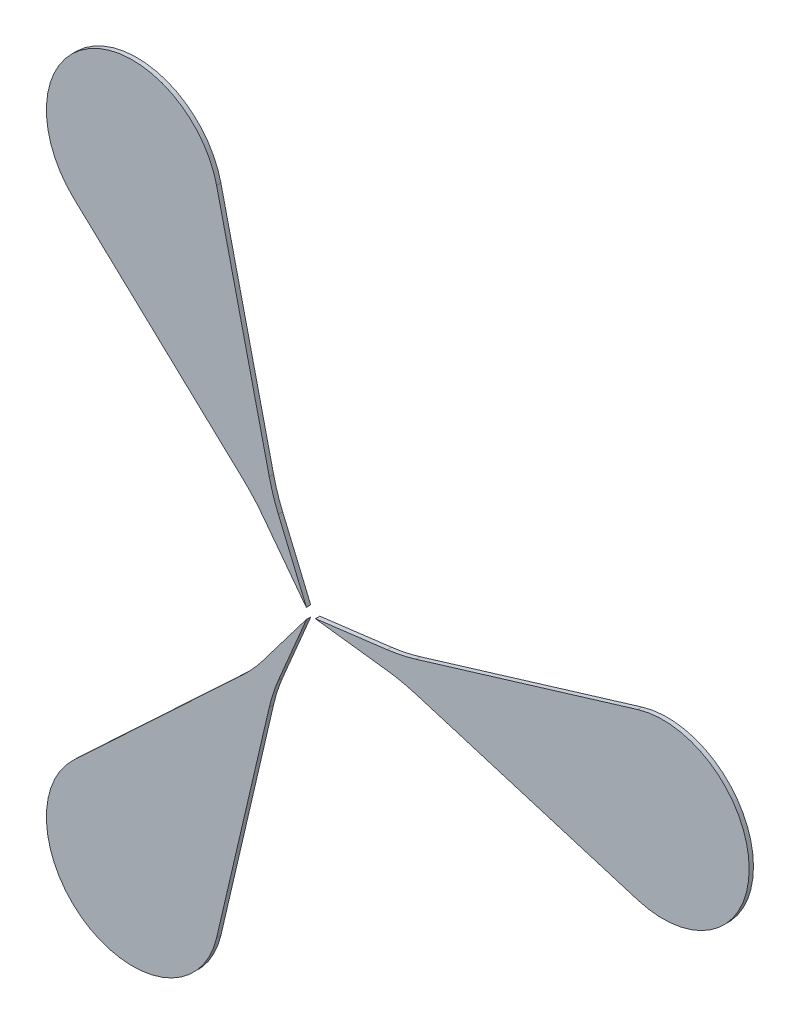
ISO-10303-21;
HEADER;
FILE_DESCRIPTION(('STEP AP214'),'2;1');
FILE_NAME('part.step','',(''),(''),'','','');
FILE_SCHEMA(('AUTOMOTIVE_DESIGN { 1 0 10303 214 1 1 1 1 }'));
ENDSEC;
DATA;
#1=APPLICATION_CONTEXT('core data for automotive mechanical design processes');
#2=APPLICATION_PROTOCOL_DEFINITION('international standard','automotive_design',2000,#1);
#3=PRODUCT_CONTEXT('',#1,'mechanical');
#4=PRODUCT('Part','Part','',(#3));
#5=PRODUCT_RELATED_PRODUCT_CATEGORY('part','',(#4));
#6=PRODUCT_DEFINITION_FORMATION('','',#4);
#7=PRODUCT_DEFINITION_CONTEXT('part definition',#1,'design');
#8=PRODUCT_DEFINITION('design','',#6,#7);
#9=PRODUCT_DEFINITION_SHAPE('','',#8);
#10=(LENGTH_UNIT() NAMED_UNIT(*) SI_UNIT(.MILLI.,.METRE.));
#11=(NAMED_UNIT(*) PLANE_ANGLE_UNIT() SI_UNIT($,.RADIAN.));
#12=(NAMED_UNIT(*) SI_UNIT($,.STERADIAN.) SOLID_ANGLE_UNIT());
#13=UNCERTAINTY_MEASURE_WITH_UNIT(LENGTH_MEASURE(1.E-05),#10,'distance_accuracy_value','');
#14=(GEOMETRIC_REPRESENTATION_CONTEXT(3) GLOBAL_UNCERTAINTY_ASSIGNED_CONTEXT((#13)) GLOBAL_UNIT_ASSIGNED_CONTEXT((#10,
#11,#12)) REPRESENTATION_CONTEXT('',''));
#15=CARTESIAN_POINT('',(0.,0.,0.));
#16=DIRECTION('',(0.,0.,1.));
#17=DIRECTION('',(1.,0.,0.));
#18=AXIS2_PLACEMENT_3D('',#15,#16,#17);
#19=CARTESIAN_POINT('',(-0.178999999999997,0.310037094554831,0.25));
#20=DIRECTION('',(0.,0.,-1.));
#21=DIRECTION('',(-1.,0.,0.));
#22=AXIS2_PLACEMENT_3D('',#19,#20,#21);
#23=CYLINDRICAL_SURFACE('',#22,0.00499999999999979);
#24=CARTESIAN_POINT('',(-0.178999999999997,0.310037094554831,0.));
#25=DIRECTION('',(0.,0.,1.));
#26=DIRECTION('',(1.,0.,0.));
#27=AXIS2_PLACEMENT_3D('',#24,#25,#26);
#28=CIRCLE('',#27,0.00499999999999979);
#29=CARTESIAN_POINT('',(-0.182987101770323,0.307019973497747,0.));
#30=VERTEX_POINT('',#29);
#31=CARTESIAN_POINT('',(-0.174393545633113,0.311981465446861,0.));
#32=VERTEX_POINT('',#31);
#33=EDGE_CURVE('E12',#30,#32,#28,.T.);
#34=ORIENTED_EDGE('',*,*,#33,.T.);
#35=DIRECTION('',(0.,0.,-1.));
#36=VECTOR('',#35,1.);
#37=CARTESIAN_POINT('',(-0.174393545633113,0.311981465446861,0.25));
#38=LINE('',#37,#36);
#39=CARTESIAN_POINT('',(-0.174393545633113,0.311981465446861,0.25));
#40=VERTEX_POINT('',#39);
#41=EDGE_CURVE('E184',#40,#32,#38,.T.);
#42=ORIENTED_EDGE('',*,*,#41,.F.);
#43=CARTESIAN_POINT('',(-0.178999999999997,0.310037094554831,0.25));
#44=DIRECTION('',(0.,0.,1.));
#45=DIRECTION('',(1.,0.,0.));
#46=AXIS2_PLACEMENT_3D('',#43,#44,#45);
#47=CIRCLE('',#46,0.00499999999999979);
#48=CARTESIAN_POINT('',(-0.182987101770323,0.307019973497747,0.25));
#49=VERTEX_POINT('',#48);
#50=EDGE_CURVE('E52',#49,#40,#47,.T.);
#51=ORIENTED_EDGE('',*,*,#50,.F.);
#52=DIRECTION('',(0.,0.,-1.));
#53=VECTOR('',#52,1.);
#54=CARTESIAN_POINT('',(-0.182987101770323,0.307019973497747,0.25));
#55=LINE('',#54,#53);
#56=EDGE_CURVE('E152',#49,#30,#55,.T.);
#57=ORIENTED_EDGE('',*,*,#56,.T.);
#58=EDGE_LOOP('',(#34,#42,#51,#57));
#59=FACE_BOUND('',#58,.T.);
#60=ADVANCED_FACE('F48',(#59),#23,.T.);
#61=CARTESIAN_POINT('',(-0.174393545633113,0.311981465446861,0.25));
#62=DIRECTION('',(-0.921290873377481,-0.388874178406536,0.));
#63=DIRECTION('',(0.388874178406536,-0.921290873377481,0.));
#64=AXIS2_PLACEMENT_3D('',#61,#62,#63);
#65=PLANE('',#64);
#66=DIRECTION('',(-0.388874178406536,0.921290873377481,0.));
#67=VECTOR('',#66,1.);
#68=CARTESIAN_POINT('',(-0.174393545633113,0.311981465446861,0.));
#69=LINE('',#68,#67);
#70=CARTESIAN_POINT('',(-1.80154369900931,4.16690079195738,0.));
#71=VERTEX_POINT('',#70);
#72=EDGE_CURVE('E58',#32,#71,#69,.T.);
#73=ORIENTED_EDGE('',*,*,#72,.T.);
#74=DIRECTION('',(0.,0.,-1.));
#75=VECTOR('',#74,1.);
#76=CARTESIAN_POINT('',(-1.80154369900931,4.16690079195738,0.25));
#77=LINE('',#76,#75);
#78=CARTESIAN_POINT('',(-1.80154369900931,4.16690079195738,0.25));
#79=VERTEX_POINT('',#78);
#80=EDGE_CURVE('E128',#79,#71,#77,.T.);
#81=ORIENTED_EDGE('',*,*,#80,.F.);
#82=DIRECTION('',(-0.388874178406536,0.921290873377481,0.));
#83=VECTOR('',#82,1.);
#84=CARTESIAN_POINT('',(-0.174393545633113,0.311981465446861,0.25));
#85=LINE('',#84,#83);
#86=EDGE_CURVE('E94',#40,#79,#85,.T.);
#87=ORIENTED_EDGE('',*,*,#86,.F.);
#88=ORIENTED_EDGE('',*,*,#41,.T.);
#89=EDGE_LOOP('',(#73,#81,#87,#88));
#90=FACE_BOUND('',#89,.T.);
#91=ADVANCED_FACE('F190',(#90),#65,.F.);
#92=CARTESIAN_POINT('',(7.41136503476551,8.05564257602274,0.25));
#93=DIRECTION('',(0.,0.,-1.));
#94=DIRECTION('',(-1.,0.,0.));
#95=AXIS2_PLACEMENT_3D('',#92,#93,#94);
#96=CYLINDRICAL_SURFACE('',#95,10.);
#97=CARTESIAN_POINT('',(7.41136503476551,8.05564257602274,0.));
#98=DIRECTION('',(0.,0.,-1.));
#99=DIRECTION('',(-1.,0.,0.));
#100=AXIS2_PLACEMENT_3D('',#97,#98,#99);
#101=CIRCLE('',#100,10.);
#102=CARTESIAN_POINT('',(-2.32776938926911,5.78644433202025,0.));
#103=VERTEX_POINT('',#102);
#104=EDGE_CURVE('E122',#71,#103,#101,.T.);
#105=ORIENTED_EDGE('',*,*,#104,.T.);
#106=DIRECTION('',(0.,0.,-1.));
#107=VECTOR('',#106,1.);
#108=CARTESIAN_POINT('',(-2.32776938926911,5.78644433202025,0.25));
#109=LINE('',#108,#107);
#110=CARTESIAN_POINT('',(-2.32776938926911,5.78644433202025,0.25));
#111=VERTEX_POINT('',#110);
#112=EDGE_CURVE('E126',#111,#103,#109,.T.);
#113=ORIENTED_EDGE('',*,*,#112,.F.);
#114=CARTESIAN_POINT('',(7.41136503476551,8.05564257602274,0.25));
#115=DIRECTION('',(0.,0.,-1.));
#116=DIRECTION('',(-1.,0.,0.));
#117=AXIS2_PLACEMENT_3D('',#114,#115,#116);
#118=CIRCLE('',#117,10.);
#119=EDGE_CURVE('E159',#79,#111,#118,.T.);
#120=ORIENTED_EDGE('',*,*,#119,.F.);
#121=ORIENTED_EDGE('',*,*,#80,.T.);
#122=EDGE_LOOP('',(#105,#113,#120,#121));
#123=FACE_BOUND('',#122,.T.);
#124=ADVANCED_FACE('F124',(#123),#96,.F.);
#125=CARTESIAN_POINT('',(-2.32776938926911,5.78644433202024,0.25));
#126=DIRECTION('',(-0.973913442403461,-0.226919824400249,0.));
#127=DIRECTION('',(0.226919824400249,-0.973913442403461,0.));
#128=AXIS2_PLACEMENT_3D('',#125,#126,#127);
#129=PLANE('',#128);
#130=DIRECTION('',(-0.226919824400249,0.973913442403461,0.));
#131=VECTOR('',#130,1.);
#132=CARTESIAN_POINT('',(-2.32776938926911,5.78644433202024,0.));
#133=LINE('',#132,#131);
#134=CARTESIAN_POINT('',(-5.3804327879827,18.8881198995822,0.));
#135=VERTEX_POINT('',#134);
#136=EDGE_CURVE('E130',#103,#135,#133,.T.);
#137=ORIENTED_EDGE('',*,*,#136,.T.);
#138=DIRECTION('',(0.,0.,-1.));
#139=VECTOR('',#138,1.);
#140=CARTESIAN_POINT('',(-5.3804327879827,18.8881198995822,0.25));
#141=LINE('',#140,#139);
#142=CARTESIAN_POINT('',(-5.3804327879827,18.8881198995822,0.25));
#143=VERTEX_POINT('',#142);
#144=EDGE_CURVE('E137',#143,#135,#141,.T.);
#145=ORIENTED_EDGE('',*,*,#144,.F.);
#146=DIRECTION('',(-0.226919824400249,0.973913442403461,0.));
#147=VECTOR('',#146,1.);
#148=CARTESIAN_POINT('',(-2.32776938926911,5.78644433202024,0.25));
#149=LINE('',#148,#147);
#150=EDGE_CURVE('E136',#111,#143,#149,.T.);
#151=ORIENTED_EDGE('',*,*,#150,.F.);
#152=ORIENTED_EDGE('',*,*,#112,.T.);
#153=EDGE_LOOP('',(#137,#145,#151,#152));
#154=FACE_BOUND('',#153,.T.);
#155=ADVANCED_FACE('F133',(#154),#129,.F.);
#156=CARTESIAN_POINT('',(-10.25,17.753520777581,0.25));
#157=DIRECTION('',(0.,0.,-1.));
#158=DIRECTION('',(-1.,0.,0.));
#159=AXIS2_PLACEMENT_3D('',#156,#157,#158);
#160=CYLINDRICAL_SURFACE('',#159,5.);
#161=CARTESIAN_POINT('',(-10.25,17.753520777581,0.));
#162=DIRECTION('',(0.,0.,1.));
#163=DIRECTION('',(1.,0.,0.));
#164=AXIS2_PLACEMENT_3D('',#161,#162,#163);
#165=CIRCLE('',#164,5.);
#166=CARTESIAN_POINT('',(-13.6673752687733,14.1036514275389,0.));
#167=VERTEX_POINT('',#166);
#168=EDGE_CURVE('E142',#135,#167,#165,.T.);
#169=ORIENTED_EDGE('',*,*,#168,.T.);
#170=DIRECTION('',(0.,0.,-1.));
#171=VECTOR('',#170,1.);
#172=CARTESIAN_POINT('',(-13.6673752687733,14.1036514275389,0.25));
#173=LINE('',#172,#171);
#174=CARTESIAN_POINT('',(-13.6673752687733,14.1036514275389,0.25));
#175=VERTEX_POINT('',#174);
#176=EDGE_CURVE('E176',#175,#167,#173,.T.);
#177=ORIENTED_EDGE('',*,*,#176,.F.);
#178=CARTESIAN_POINT('',(-10.25,17.753520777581,0.25));
#179=DIRECTION('',(0.,0.,1.));
#180=DIRECTION('',(1.,0.,0.));
#181=AXIS2_PLACEMENT_3D('',#178,#179,#180);
#182=CIRCLE('',#181,5.);
#183=EDGE_CURVE('E156',#143,#175,#182,.T.);
#184=ORIENTED_EDGE('',*,*,#183,.F.);
#185=ORIENTED_EDGE('',*,*,#144,.T.);
#186=EDGE_LOOP('',(#169,#177,#184,#185));
#187=FACE_BOUND('',#186,.T.);
#188=ADVANCED_FACE('F193',(#187),#160,.T.);
#189=CARTESIAN_POINT('',(-3.84732309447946,4.90912959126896,0.25));
#190=DIRECTION('',(0.68347505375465,0.729973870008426,0.));
#191=DIRECTION('',(-0.729973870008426,0.68347505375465,0.));
#192=AXIS2_PLACEMENT_3D('',#189,#190,#191);
#193=PLANE('',#192);
#194=DIRECTION('',(0.729973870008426,-0.68347505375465,0.));
#195=VECTOR('',#194,1.);
#196=CARTESIAN_POINT('',(-3.84732309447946,4.90912959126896,0.));
#197=LINE('',#196,#195);
#198=CARTESIAN_POINT('',(-3.84732309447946,4.90912959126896,0.));
#199=VERTEX_POINT('',#198);
#200=EDGE_CURVE('E144',#167,#199,#197,.T.);
#201=ORIENTED_EDGE('',*,*,#200,.T.);
#202=DIRECTION('',(0.,0.,-1.));
#203=VECTOR('',#202,1.);
#204=CARTESIAN_POINT('',(-3.84732309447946,4.90912959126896,0.25));
#205=LINE('',#204,#203);
#206=CARTESIAN_POINT('',(-3.84732309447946,4.90912959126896,0.25));
#207=VERTEX_POINT('',#206);
#208=EDGE_CURVE('E173',#207,#199,#205,.T.);
#209=ORIENTED_EDGE('',*,*,#208,.F.);
#210=DIRECTION('',(0.729973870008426,-0.68347505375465,0.));
#211=VECTOR('',#210,1.);
#212=CARTESIAN_POINT('',(-3.84732309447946,4.90912959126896,0.25));
#213=LINE('',#212,#211);
#214=EDGE_CURVE('E154',#175,#207,#213,.T.);
#215=ORIENTED_EDGE('',*,*,#214,.F.);
#216=ORIENTED_EDGE('',*,*,#176,.T.);
#217=EDGE_LOOP('',(#201,#209,#215,#216));
#218=FACE_BOUND('',#217,.T.);
#219=ADVANCED_FACE('F171',(#218),#193,.F.);
#220=CARTESIAN_POINT('',(-10.682073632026,-2.39060910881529,0.25));
#221=DIRECTION('',(0.,0.,-1.));
#222=DIRECTION('',(-1.,0.,0.));
#223=AXIS2_PLACEMENT_3D('',#220,#221,#222);
#224=CYLINDRICAL_SURFACE('',#223,10.);
#225=CARTESIAN_POINT('',(-10.682073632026,-2.39060910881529,0.));
#226=DIRECTION('',(0.,0.,-1.));
#227=DIRECTION('',(1.,0.,0.));
#228=AXIS2_PLACEMENT_3D('',#225,#226,#227);
#229=CIRCLE('',#228,10.);
#230=CARTESIAN_POINT('',(-2.70787009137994,3.64363300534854,0.));
#231=VERTEX_POINT('',#230);
#232=EDGE_CURVE('E162',#199,#231,#229,.T.);
#233=ORIENTED_EDGE('',*,*,#232,.T.);
#234=DIRECTION('',(0.,0.,-1.));
#235=VECTOR('',#234,1.);
#236=CARTESIAN_POINT('',(-2.70787009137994,3.64363300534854,0.25));
#237=LINE('',#236,#235);
#238=CARTESIAN_POINT('',(-2.70787009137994,3.64363300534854,0.25));
#239=VERTEX_POINT('',#238);
#240=EDGE_CURVE('E181',#239,#231,#237,.T.);
#241=ORIENTED_EDGE('',*,*,#240,.F.);
#242=CARTESIAN_POINT('',(-10.682073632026,-2.39060910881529,0.25));
#243=DIRECTION('',(0.,0.,-1.));
#244=DIRECTION('',(1.,0.,0.));
#245=AXIS2_PLACEMENT_3D('',#242,#243,#244);
#246=CIRCLE('',#245,10.);
#247=EDGE_CURVE('E151',#207,#239,#246,.T.);
#248=ORIENTED_EDGE('',*,*,#247,.F.);
#249=ORIENTED_EDGE('',*,*,#208,.T.);
#250=EDGE_LOOP('',(#233,#241,#248,#249));
#251=FACE_BOUND('',#250,.T.);
#252=ADVANCED_FACE('F179',(#251),#224,.F.);
#253=CARTESIAN_POINT('',(-0.182987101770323,0.307019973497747,0.25));
#254=DIRECTION('',(0.797420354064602,0.603424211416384,0.));
#255=DIRECTION('',(-0.603424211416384,0.797420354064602,0.));
#256=AXIS2_PLACEMENT_3D('',#253,#254,#255);
#257=PLANE('',#256);
#258=DIRECTION('',(0.603424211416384,-0.797420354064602,0.));
#259=VECTOR('',#258,1.);
#260=CARTESIAN_POINT('',(-0.182987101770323,0.307019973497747,0.));
#261=LINE('',#260,#259);
#262=EDGE_CURVE('E105',#231,#30,#261,.T.);
#263=ORIENTED_EDGE('',*,*,#262,.T.);
#264=ORIENTED_EDGE('',*,*,#56,.F.);
#265=DIRECTION('',(0.603424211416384,-0.797420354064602,0.));
#266=VECTOR('',#265,1.);
#267=CARTESIAN_POINT('',(-0.182987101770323,0.307019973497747,0.25));
#268=LINE('',#267,#266);
#269=EDGE_CURVE('E149',#239,#49,#268,.T.);
#270=ORIENTED_EDGE('',*,*,#269,.F.);
#271=ORIENTED_EDGE('',*,*,#240,.T.);
#272=EDGE_LOOP('',(#263,#264,#270,#271));
#273=FACE_BOUND('',#272,.T.);
#274=ADVANCED_FACE('F194',(#273),#257,.F.);
#275=CARTESIAN_POINT('',(-0.178999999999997,0.310037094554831,0.25));
#276=DIRECTION('',(0.,0.,1.));
#277=DIRECTION('',(1.,0.,0.));
#278=AXIS2_PLACEMENT_3D('',#275,#276,#277);
#279=PLANE('',#278);
#280=ORIENTED_EDGE('',*,*,#50,.T.);
#281=ORIENTED_EDGE('',*,*,#86,.T.);
#282=ORIENTED_EDGE('',*,*,#119,.T.);
#283=ORIENTED_EDGE('',*,*,#150,.T.);
#284=ORIENTED_EDGE('',*,*,#183,.T.);
#285=ORIENTED_EDGE('',*,*,#214,.T.);
#286=ORIENTED_EDGE('',*,*,#247,.T.);
#287=ORIENTED_EDGE('',*,*,#269,.T.);
#288=EDGE_LOOP('',(#280,#281,#282,#283,#284,#285,#286,#287));
#289=FACE_BOUND('',#288,.T.);
#290=ADVANCED_FACE('F50',(#289),#279,.T.);
#291=CARTESIAN_POINT('',(-0.178999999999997,0.310037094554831,0.));
#292=DIRECTION('',(0.,0.,1.));
#293=DIRECTION('',(1.,0.,0.));
#294=AXIS2_PLACEMENT_3D('',#291,#292,#293);
#295=PLANE('',#294);
#296=ORIENTED_EDGE('',*,*,#33,.F.);
#297=ORIENTED_EDGE('',*,*,#262,.F.);
#298=ORIENTED_EDGE('',*,*,#232,.F.);
#299=ORIENTED_EDGE('',*,*,#200,.F.);
#300=ORIENTED_EDGE('',*,*,#168,.F.);
#301=ORIENTED_EDGE('',*,*,#136,.F.);
#302=ORIENTED_EDGE('',*,*,#104,.F.);
#303=ORIENTED_EDGE('',*,*,#72,.F.);
#304=EDGE_LOOP('',(#296,#297,#298,#299,#300,#301,#302,#303));
#305=FACE_BOUND('',#304,.T.);
#306=ADVANCED_FACE('F140',(#305),#295,.F.);
#307=CLOSED_SHELL('',(#60,#91,#124,#155,#188,#219,#252,#274,#290,#306));
#308=MANIFOLD_SOLID_BREP('B2',#307);
#309=CARTESIAN_POINT('',(-0.179,-0.310037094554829,0.25));
#310=DIRECTION('',(0.,0.,-1.));
#311=DIRECTION('',(-1.,0.,0.));
#312=AXIS2_PLACEMENT_3D('',#309,#310,#311);
#313=CYLINDRICAL_SURFACE('',#312,0.00499999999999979);
#314=CARTESIAN_POINT('',(-0.179,-0.310037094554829,0.));
#315=DIRECTION('',(0.,0.,1.));
#316=DIRECTION('',(1.,0.,0.));
#317=AXIS2_PLACEMENT_3D('',#314,#315,#316);
#318=CIRCLE('',#317,0.00499999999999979);
#319=CARTESIAN_POINT('',(-0.174393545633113,-0.311981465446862,0.));
#320=VERTEX_POINT('',#319);
#321=CARTESIAN_POINT('',(-0.182987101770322,-0.307019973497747,0.));
#322=VERTEX_POINT('',#321);
#323=EDGE_CURVE('E46',#320,#322,#318,.T.);
#324=ORIENTED_EDGE('',*,*,#323,.T.);
#325=DIRECTION('',(0.,0.,-1.));
#326=VECTOR('',#325,1.);
#327=CARTESIAN_POINT('',(-0.182987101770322,-0.307019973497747,0.25));
#328=LINE('',#327,#326);
#329=CARTESIAN_POINT('',(-0.182987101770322,-0.307019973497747,0.25));
#330=VERTEX_POINT('',#329);
#331=EDGE_CURVE('E441',#330,#322,#328,.T.);
#332=ORIENTED_EDGE('',*,*,#331,.F.);
#333=CARTESIAN_POINT('',(-0.179,-0.310037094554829,0.25));
#334=DIRECTION('',(0.,0.,1.));
#335=DIRECTION('',(1.,0.,0.));
#336=AXIS2_PLACEMENT_3D('',#333,#334,#335);
#337=CIRCLE('',#336,0.00499999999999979);
#338=CARTESIAN_POINT('',(-0.174393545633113,-0.311981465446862,0.25));
#339=VERTEX_POINT('',#338);
#340=EDGE_CURVE('E309',#339,#330,#337,.T.);
#341=ORIENTED_EDGE('',*,*,#340,.F.);
#342=DIRECTION('',(0.,0.,-1.));
#343=VECTOR('',#342,1.);
#344=CARTESIAN_POINT('',(-0.174393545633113,-0.311981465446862,0.25));
#345=LINE('',#344,#343);
#346=EDGE_CURVE('E409',#339,#320,#345,.T.);
#347=ORIENTED_EDGE('',*,*,#346,.T.);
#348=EDGE_LOOP('',(#324,#332,#341,#347));
#349=FACE_BOUND('',#348,.T.);
#350=ADVANCED_FACE('F305',(#349),#313,.T.);
#351=CARTESIAN_POINT('',(-0.182987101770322,-0.307019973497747,0.25));
#352=DIRECTION('',(0.797420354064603,-0.603424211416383,0.));
#353=DIRECTION('',(0.603424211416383,0.797420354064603,0.));
#354=AXIS2_PLACEMENT_3D('',#351,#352,#353);
#355=PLANE('',#354);
#356=DIRECTION('',(-0.603424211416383,-0.797420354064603,0.));
#357=VECTOR('',#356,1.);
#358=CARTESIAN_POINT('',(-0.182987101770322,-0.307019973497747,0.));
#359=LINE('',#358,#357);
#360=CARTESIAN_POINT('',(-2.70787009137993,-3.64363300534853,0.));
#361=VERTEX_POINT('',#360);
#362=EDGE_CURVE('E315',#322,#361,#359,.T.);
#363=ORIENTED_EDGE('',*,*,#362,.T.);
#364=DIRECTION('',(0.,0.,-1.));
#365=VECTOR('',#364,1.);
#366=CARTESIAN_POINT('',(-2.70787009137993,-3.64363300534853,0.25));
#367=LINE('',#366,#365);
#368=CARTESIAN_POINT('',(-2.70787009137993,-3.64363300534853,0.25));
#369=VERTEX_POINT('',#368);
#370=EDGE_CURVE('E385',#369,#361,#367,.T.);
#371=ORIENTED_EDGE('',*,*,#370,.F.);
#372=DIRECTION('',(-0.603424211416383,-0.797420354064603,0.));
#373=VECTOR('',#372,1.);
#374=CARTESIAN_POINT('',(-0.182987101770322,-0.307019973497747,0.25));
#375=LINE('',#374,#373);
#376=EDGE_CURVE('E351',#330,#369,#375,.T.);
#377=ORIENTED_EDGE('',*,*,#376,.F.);
#378=ORIENTED_EDGE('',*,*,#331,.T.);
#379=EDGE_LOOP('',(#363,#371,#377,#378));
#380=FACE_BOUND('',#379,.T.);
#381=ADVANCED_FACE('F447',(#380),#355,.F.);
#382=CARTESIAN_POINT('',(-10.682073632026,2.39060910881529,0.25));
#383=DIRECTION('',(0.,0.,-1.));
#384=DIRECTION('',(-1.,0.,0.));
#385=AXIS2_PLACEMENT_3D('',#382,#383,#384);
#386=CYLINDRICAL_SURFACE('',#385,10.);
#387=CARTESIAN_POINT('',(-10.682073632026,2.39060910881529,0.));
#388=DIRECTION('',(0.,0.,-1.));
#389=DIRECTION('',(-1.,0.,0.));
#390=AXIS2_PLACEMENT_3D('',#387,#388,#389);
#391=CIRCLE('',#390,10.);
#392=CARTESIAN_POINT('',(-3.84732309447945,-4.90912959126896,0.));
#393=VERTEX_POINT('',#392);
#394=EDGE_CURVE('E379',#361,#393,#391,.T.);
#395=ORIENTED_EDGE('',*,*,#394,.T.);
#396=DIRECTION('',(0.,0.,-1.));
#397=VECTOR('',#396,1.);
#398=CARTESIAN_POINT('',(-3.84732309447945,-4.90912959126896,0.25));
#399=LINE('',#398,#397);
#400=CARTESIAN_POINT('',(-3.84732309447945,-4.90912959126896,0.25));
#401=VERTEX_POINT('',#400);
#402=EDGE_CURVE('E383',#401,#393,#399,.T.);
#403=ORIENTED_EDGE('',*,*,#402,.F.);
#404=CARTESIAN_POINT('',(-10.682073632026,2.39060910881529,0.25));
#405=DIRECTION('',(0.,0.,-1.));
#406=DIRECTION('',(-1.,0.,0.));
#407=AXIS2_PLACEMENT_3D('',#404,#405,#406);
#408=CIRCLE('',#407,10.);
#409=EDGE_CURVE('E416',#369,#401,#408,.T.);
#410=ORIENTED_EDGE('',*,*,#409,.F.);
#411=ORIENTED_EDGE('',*,*,#370,.T.);
#412=EDGE_LOOP('',(#395,#403,#410,#411));
#413=FACE_BOUND('',#412,.T.);
#414=ADVANCED_FACE('F381',(#413),#386,.F.);
#415=CARTESIAN_POINT('',(-3.84732309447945,-4.90912959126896,0.25));
#416=DIRECTION('',(0.68347505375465,-0.729973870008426,0.));
#417=DIRECTION('',(0.729973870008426,0.68347505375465,0.));
#418=AXIS2_PLACEMENT_3D('',#415,#416,#417);
#419=PLANE('',#418);
#420=DIRECTION('',(-0.729973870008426,-0.68347505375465,0.));
#421=VECTOR('',#420,1.);
#422=CARTESIAN_POINT('',(-3.84732309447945,-4.90912959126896,0.));
#423=LINE('',#422,#421);
#424=CARTESIAN_POINT('',(-13.6673752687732,-14.1036514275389,0.));
#425=VERTEX_POINT('',#424);
#426=EDGE_CURVE('E387',#393,#425,#423,.T.);
#427=ORIENTED_EDGE('',*,*,#426,.T.);
#428=DIRECTION('',(0.,0.,-1.));
#429=VECTOR('',#428,1.);
#430=CARTESIAN_POINT('',(-13.6673752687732,-14.1036514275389,0.25));
#431=LINE('',#430,#429);
#432=CARTESIAN_POINT('',(-13.6673752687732,-14.1036514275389,0.25));
#433=VERTEX_POINT('',#432);
#434=EDGE_CURVE('E394',#433,#425,#431,.T.);
#435=ORIENTED_EDGE('',*,*,#434,.F.);
#436=DIRECTION('',(-0.729973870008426,-0.68347505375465,0.));
#437=VECTOR('',#436,1.);
#438=CARTESIAN_POINT('',(-3.84732309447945,-4.90912959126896,0.25));
#439=LINE('',#438,#437);
#440=EDGE_CURVE('E393',#401,#433,#439,.T.);
#441=ORIENTED_EDGE('',*,*,#440,.F.);
#442=ORIENTED_EDGE('',*,*,#402,.T.);
#443=EDGE_LOOP('',(#427,#435,#441,#442));
#444=FACE_BOUND('',#443,.T.);
#445=ADVANCED_FACE('F390',(#444),#419,.F.);
#446=CARTESIAN_POINT('',(-10.25,-17.753520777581,0.25));
#447=DIRECTION('',(0.,0.,-1.));
#448=DIRECTION('',(-1.,0.,0.));
#449=AXIS2_PLACEMENT_3D('',#446,#447,#448);
#450=CYLINDRICAL_SURFACE('',#449,5.);
#451=CARTESIAN_POINT('',(-10.25,-17.753520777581,0.));
#452=DIRECTION('',(0.,0.,1.));
#453=DIRECTION('',(1.,0.,0.));
#454=AXIS2_PLACEMENT_3D('',#451,#452,#453);
#455=CIRCLE('',#454,5.);
#456=CARTESIAN_POINT('',(-5.38043278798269,-18.8881198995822,0.));
#457=VERTEX_POINT('',#456);
#458=EDGE_CURVE('E399',#425,#457,#455,.T.);
#459=ORIENTED_EDGE('',*,*,#458,.T.);
#460=DIRECTION('',(0.,0.,-1.));
#461=VECTOR('',#460,1.);
#462=CARTESIAN_POINT('',(-5.38043278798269,-18.8881198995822,0.25));
#463=LINE('',#462,#461);
#464=CARTESIAN_POINT('',(-5.38043278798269,-18.8881198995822,0.25));
#465=VERTEX_POINT('',#464);
#466=EDGE_CURVE('E433',#465,#457,#463,.T.);
#467=ORIENTED_EDGE('',*,*,#466,.F.);
#468=CARTESIAN_POINT('',(-10.25,-17.753520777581,0.25));
#469=DIRECTION('',(0.,0.,1.));
#470=DIRECTION('',(1.,0.,0.));
#471=AXIS2_PLACEMENT_3D('',#468,#469,#470);
#472=CIRCLE('',#471,5.);
#473=EDGE_CURVE('E413',#433,#465,#472,.T.);
#474=ORIENTED_EDGE('',*,*,#473,.F.);
#475=ORIENTED_EDGE('',*,*,#434,.T.);
#476=EDGE_LOOP('',(#459,#467,#474,#475));
#477=FACE_BOUND('',#476,.T.);
#478=ADVANCED_FACE('F450',(#477),#450,.T.);
#479=CARTESIAN_POINT('',(-2.32776938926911,-5.78644433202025,0.25));
#480=DIRECTION('',(-0.973913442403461,0.226919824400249,0.));
#481=DIRECTION('',(-0.226919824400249,-0.973913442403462,0.));
#482=AXIS2_PLACEMENT_3D('',#479,#480,#481);
#483=PLANE('',#482);
#484=DIRECTION('',(0.226919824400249,0.973913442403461,0.));
#485=VECTOR('',#484,1.);
#486=CARTESIAN_POINT('',(-2.32776938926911,-5.78644433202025,0.));
#487=LINE('',#486,#485);
#488=CARTESIAN_POINT('',(-2.32776938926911,-5.78644433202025,0.));
#489=VERTEX_POINT('',#488);
#490=EDGE_CURVE('E401',#457,#489,#487,.T.);
#491=ORIENTED_EDGE('',*,*,#490,.T.);
#492=DIRECTION('',(0.,0.,-1.));
#493=VECTOR('',#492,1.);
#494=CARTESIAN_POINT('',(-2.32776938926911,-5.78644433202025,0.25));
#495=LINE('',#494,#493);
#496=CARTESIAN_POINT('',(-2.32776938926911,-5.78644433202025,0.25));
#497=VERTEX_POINT('',#496);
#498=EDGE_CURVE('E430',#497,#489,#495,.T.);
#499=ORIENTED_EDGE('',*,*,#498,.F.);
#500=DIRECTION('',(0.226919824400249,0.973913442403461,0.));
#501=VECTOR('',#500,1.);
#502=CARTESIAN_POINT('',(-2.32776938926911,-5.78644433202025,0.25));
#503=LINE('',#502,#501);
#504=EDGE_CURVE('E411',#465,#497,#503,.T.);
#505=ORIENTED_EDGE('',*,*,#504,.F.);
#506=ORIENTED_EDGE('',*,*,#466,.T.);
#507=EDGE_LOOP('',(#491,#499,#505,#506));
#508=FACE_BOUND('',#507,.T.);
#509=ADVANCED_FACE('F428',(#508),#483,.F.);
#510=CARTESIAN_POINT('',(7.41136503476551,-8.05564257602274,0.25));
#511=DIRECTION('',(0.,0.,-1.));
#512=DIRECTION('',(-1.,0.,0.));
#513=AXIS2_PLACEMENT_3D('',#510,#511,#512);
#514=CYLINDRICAL_SURFACE('',#513,10.);
#515=CARTESIAN_POINT('',(7.41136503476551,-8.05564257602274,0.));
#516=DIRECTION('',(0.,0.,-1.));
#517=DIRECTION('',(1.,0.,0.));
#518=AXIS2_PLACEMENT_3D('',#515,#516,#517);
#519=CIRCLE('',#518,10.);
#520=CARTESIAN_POINT('',(-1.80154369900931,-4.16690079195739,0.));
#521=VERTEX_POINT('',#520);
#522=EDGE_CURVE('E419',#489,#521,#519,.T.);
#523=ORIENTED_EDGE('',*,*,#522,.T.);
#524=DIRECTION('',(0.,0.,-1.));
#525=VECTOR('',#524,1.);
#526=CARTESIAN_POINT('',(-1.80154369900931,-4.16690079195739,0.25));
#527=LINE('',#526,#525);
#528=CARTESIAN_POINT('',(-1.80154369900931,-4.16690079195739,0.25));
#529=VERTEX_POINT('',#528);
#530=EDGE_CURVE('E438',#529,#521,#527,.T.);
#531=ORIENTED_EDGE('',*,*,#530,.F.);
#532=CARTESIAN_POINT('',(7.41136503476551,-8.05564257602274,0.25));
#533=DIRECTION('',(0.,0.,-1.));
#534=DIRECTION('',(1.,0.,0.));
#535=AXIS2_PLACEMENT_3D('',#532,#533,#534);
#536=CIRCLE('',#535,10.);
#537=EDGE_CURVE('E408',#497,#529,#536,.T.);
#538=ORIENTED_EDGE('',*,*,#537,.F.);
#539=ORIENTED_EDGE('',*,*,#498,.T.);
#540=EDGE_LOOP('',(#523,#531,#538,#539));
#541=FACE_BOUND('',#540,.T.);
#542=ADVANCED_FACE('F436',(#541),#514,.F.);
#543=CARTESIAN_POINT('',(-0.174393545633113,-0.311981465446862,0.25));
#544=DIRECTION('',(-0.921290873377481,0.388874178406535,0.));
#545=DIRECTION('',(-0.388874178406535,-0.921290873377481,0.));
#546=AXIS2_PLACEMENT_3D('',#543,#544,#545);
#547=PLANE('',#546);
#548=DIRECTION('',(0.388874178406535,0.921290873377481,0.));
#549=VECTOR('',#548,1.);
#550=CARTESIAN_POINT('',(-0.174393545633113,-0.311981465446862,0.));
#551=LINE('',#550,#549);
#552=EDGE_CURVE('E362',#521,#320,#551,.T.);
#553=ORIENTED_EDGE('',*,*,#552,.T.);
#554=ORIENTED_EDGE('',*,*,#346,.F.);
#555=DIRECTION('',(0.388874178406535,0.921290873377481,0.));
#556=VECTOR('',#555,1.);
#557=CARTESIAN_POINT('',(-0.174393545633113,-0.311981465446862,0.25));
#558=LINE('',#557,#556);
#559=EDGE_CURVE('E406',#529,#339,#558,.T.);
#560=ORIENTED_EDGE('',*,*,#559,.F.);
#561=ORIENTED_EDGE('',*,*,#530,.T.);
#562=EDGE_LOOP('',(#553,#554,#560,#561));
#563=FACE_BOUND('',#562,.T.);
#564=ADVANCED_FACE('F451',(#563),#547,.F.);
#565=CARTESIAN_POINT('',(-0.179,-0.310037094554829,0.25));
#566=DIRECTION('',(0.,0.,1.));
#567=DIRECTION('',(1.,0.,0.));
#568=AXIS2_PLACEMENT_3D('',#565,#566,#567);
#569=PLANE('',#568);
#570=ORIENTED_EDGE('',*,*,#340,.T.);
#571=ORIENTED_EDGE('',*,*,#376,.T.);
#572=ORIENTED_EDGE('',*,*,#409,.T.);
#573=ORIENTED_EDGE('',*,*,#440,.T.);
#574=ORIENTED_EDGE('',*,*,#473,.T.);
#575=ORIENTED_EDGE('',*,*,#504,.T.);
#576=ORIENTED_EDGE('',*,*,#537,.T.);
#577=ORIENTED_EDGE('',*,*,#559,.T.);
#578=EDGE_LOOP('',(#570,#571,#572,#573,#574,#575,#576,#577));
#579=FACE_BOUND('',#578,.T.);
#580=ADVANCED_FACE('F307',(#579),#569,.T.);
#581=CARTESIAN_POINT('',(-0.179,-0.310037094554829,0.));
#582=DIRECTION('',(0.,0.,1.));
#583=DIRECTION('',(1.,0.,0.));
#584=AXIS2_PLACEMENT_3D('',#581,#582,#583);
#585=PLANE('',#584);
#586=ORIENTED_EDGE('',*,*,#323,.F.);
#587=ORIENTED_EDGE('',*,*,#552,.F.);
#588=ORIENTED_EDGE('',*,*,#522,.F.);
#589=ORIENTED_EDGE('',*,*,#490,.F.);
#590=ORIENTED_EDGE('',*,*,#458,.F.);
#591=ORIENTED_EDGE('',*,*,#426,.F.);
#592=ORIENTED_EDGE('',*,*,#394,.F.);
#593=ORIENTED_EDGE('',*,*,#362,.F.);
#594=EDGE_LOOP('',(#586,#587,#588,#589,#590,#591,#592,#593));
#595=FACE_BOUND('',#594,.T.);
#596=ADVANCED_FACE('F397',(#595),#585,.F.);
#597=CLOSED_SHELL('',(#350,#381,#414,#445,#478,#509,#542,#564,#580,#596));
#598=MANIFOLD_SOLID_BREP('B6',#597);
#599=CARTESIAN_POINT('',(0.358,0.,0.25));
#600=DIRECTION('',(0.,0.,-1.));
#601=DIRECTION('',(-1.,0.,0.));
#602=AXIS2_PLACEMENT_3D('',#599,#600,#601);
#603=CYLINDRICAL_SURFACE('',#602,0.0049999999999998);
#604=CARTESIAN_POINT('',(0.358,0.,0.));
#605=DIRECTION('',(0.,0.,1.));
#606=DIRECTION('',(1.,0.,0.));
#607=AXIS2_PLACEMENT_3D('',#604,#605,#606);
#608=CIRCLE('',#607,0.0049999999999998);
#609=CARTESIAN_POINT('',(0.357380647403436,0.00496149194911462,0.));
#610=VERTEX_POINT('',#609);
#611=CARTESIAN_POINT('',(0.357380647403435,-0.00496149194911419,0.));
#612=VERTEX_POINT('',#611);
#613=EDGE_CURVE('E655',#610,#612,#608,.T.);
#614=ORIENTED_EDGE('',*,*,#613,.T.);
#615=DIRECTION('',(0.,0.,-1.));
#616=VECTOR('',#615,1.);
#617=CARTESIAN_POINT('',(0.357380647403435,-0.00496149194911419,0.25));
#618=LINE('',#617,#616);
#619=CARTESIAN_POINT('',(0.357380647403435,-0.00496149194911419,0.25));
#620=VERTEX_POINT('',#619);
#621=EDGE_CURVE('E303',#620,#612,#618,.T.);
#622=ORIENTED_EDGE('',*,*,#621,.F.);
#623=CARTESIAN_POINT('',(0.358,0.,0.25));
#624=DIRECTION('',(0.,0.,1.));
#625=DIRECTION('',(1.,0.,0.));
#626=AXIS2_PLACEMENT_3D('',#623,#624,#625);
#627=CIRCLE('',#626,0.0049999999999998);
#628=CARTESIAN_POINT('',(0.357380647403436,0.00496149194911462,0.25));
#629=VERTEX_POINT('',#628);
#630=EDGE_CURVE('E669',#629,#620,#627,.T.);
#631=ORIENTED_EDGE('',*,*,#630,.F.);
#632=DIRECTION('',(0.,0.,-1.));
#633=VECTOR('',#632,1.);
#634=CARTESIAN_POINT('',(0.357380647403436,0.00496149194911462,0.25));
#635=LINE('',#634,#633);
#636=EDGE_CURVE('E651',#629,#610,#635,.T.);
#637=ORIENTED_EDGE('',*,*,#636,.T.);
#638=EDGE_LOOP('',(#614,#622,#631,#637));
#639=FACE_BOUND('',#638,.T.);
#640=ADVANCED_FACE('F559',(#639),#603,.T.);
#641=CARTESIAN_POINT('',(0.357380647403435,-0.00496149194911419,0.25));
#642=DIRECTION('',(0.123870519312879,0.992298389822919,0.));
#643=DIRECTION('',(-0.992298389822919,0.123870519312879,0.));
#644=AXIS2_PLACEMENT_3D('',#641,#642,#643);
#645=PLANE('',#644);
#646=DIRECTION('',(0.992298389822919,-0.123870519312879,0.));
#647=VECTOR('',#646,1.);
#648=CARTESIAN_POINT('',(0.357380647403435,-0.00496149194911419,0.));
#649=LINE('',#648,#647);
#650=CARTESIAN_POINT('',(4.50941379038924,-0.523267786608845,0.));
#651=VERTEX_POINT('',#650);
#652=EDGE_CURVE('E658',#612,#651,#649,.T.);
#653=ORIENTED_EDGE('',*,*,#652,.T.);
#654=DIRECTION('',(0.,0.,-1.));
#655=VECTOR('',#654,1.);
#656=CARTESIAN_POINT('',(4.50941379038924,-0.523267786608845,0.25));
#657=LINE('',#656,#655);
#658=CARTESIAN_POINT('',(4.50941379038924,-0.523267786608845,0.25));
#659=VERTEX_POINT('',#658);
#660=EDGE_CURVE('E567',#659,#651,#657,.T.);
#661=ORIENTED_EDGE('',*,*,#660,.F.);
#662=DIRECTION('',(0.992298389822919,-0.123870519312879,0.));
#663=VECTOR('',#662,1.);
#664=CARTESIAN_POINT('',(0.357380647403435,-0.00496149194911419,0.25));
#665=LINE('',#664,#663);
#666=EDGE_CURVE('E618',#620,#659,#665,.T.);
#667=ORIENTED_EDGE('',*,*,#666,.F.);
#668=ORIENTED_EDGE('',*,*,#621,.T.);
#669=EDGE_LOOP('',(#653,#661,#667,#668));
#670=FACE_BOUND('',#669,.T.);
#671=ADVANCED_FACE('F704',(#670),#645,.F.);
#672=CARTESIAN_POINT('',(3.27070859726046,-10.446251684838,0.25));
#673=DIRECTION('',(0.,0.,-1.));
#674=DIRECTION('',(-1.,0.,0.));
#675=AXIS2_PLACEMENT_3D('',#672,#673,#674);
#676=CYLINDRICAL_SURFACE('',#675,10.);
#677=CARTESIAN_POINT('',(3.27070859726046,-10.446251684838,0.));
#678=DIRECTION('',(0.,0.,-1.));
#679=DIRECTION('',(-1.,0.,0.));
#680=AXIS2_PLACEMENT_3D('',#677,#678,#679);
#681=CIRCLE('',#680,10.);
#682=CARTESIAN_POINT('',(6.17509248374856,-0.877314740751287,0.));
#683=VERTEX_POINT('',#682);
#684=EDGE_CURVE('E660',#651,#683,#681,.T.);
#685=ORIENTED_EDGE('',*,*,#684,.T.);
#686=DIRECTION('',(0.,0.,-1.));
#687=VECTOR('',#686,1.);
#688=CARTESIAN_POINT('',(6.17509248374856,-0.877314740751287,0.25));
#689=LINE('',#688,#687);
#690=CARTESIAN_POINT('',(6.17509248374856,-0.877314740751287,0.25));
#691=VERTEX_POINT('',#690);
#692=EDGE_CURVE('E676',#691,#683,#689,.T.);
#693=ORIENTED_EDGE('',*,*,#692,.F.);
#694=CARTESIAN_POINT('',(3.27070859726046,-10.446251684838,0.25));
#695=DIRECTION('',(0.,0.,-1.));
#696=DIRECTION('',(-1.,0.,0.));
#697=AXIS2_PLACEMENT_3D('',#694,#695,#696);
#698=CIRCLE('',#697,10.);
#699=EDGE_CURVE('E684',#659,#691,#698,.T.);
#700=ORIENTED_EDGE('',*,*,#699,.F.);
#701=ORIENTED_EDGE('',*,*,#660,.T.);
#702=EDGE_LOOP('',(#685,#693,#700,#701));
#703=FACE_BOUND('',#702,.T.);
#704=ADVANCED_FACE('F682',(#703),#676,.F.);
#705=CARTESIAN_POINT('',(6.17509248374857,-0.877314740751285,0.25));
#706=DIRECTION('',(0.290438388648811,0.956893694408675,0.));
#707=DIRECTION('',(-0.956893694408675,0.290438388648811,0.));
#708=AXIS2_PLACEMENT_3D('',#705,#706,#707);
#709=PLANE('',#708);
#710=DIRECTION('',(0.956893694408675,-0.290438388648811,0.));
#711=VECTOR('',#710,1.);
#712=CARTESIAN_POINT('',(6.17509248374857,-0.877314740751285,0.));
#713=LINE('',#712,#711);
#714=CARTESIAN_POINT('',(19.0478080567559,-4.78446847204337,0.));
#715=VERTEX_POINT('',#714);
#716=EDGE_CURVE('E662',#683,#715,#713,.T.);
#717=ORIENTED_EDGE('',*,*,#716,.T.);
#718=DIRECTION('',(0.,0.,-1.));
#719=VECTOR('',#718,1.);
#720=CARTESIAN_POINT('',(19.0478080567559,-4.78446847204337,0.25));
#721=LINE('',#720,#719);
#722=CARTESIAN_POINT('',(19.0478080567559,-4.78446847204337,0.25));
#723=VERTEX_POINT('',#722);
#724=EDGE_CURVE('E673',#723,#715,#721,.T.);
#725=ORIENTED_EDGE('',*,*,#724,.F.);
#726=DIRECTION('',(0.956893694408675,-0.290438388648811,0.));
#727=VECTOR('',#726,1.);
#728=CARTESIAN_POINT('',(6.17509248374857,-0.877314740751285,0.25));
#729=LINE('',#728,#727);
#730=EDGE_CURVE('E696',#691,#723,#729,.T.);
#731=ORIENTED_EDGE('',*,*,#730,.F.);
#732=ORIENTED_EDGE('',*,*,#692,.T.);
#733=EDGE_LOOP('',(#717,#725,#731,#732));
#734=FACE_BOUND('',#733,.T.);
#735=ADVANCED_FACE('F692',(#734),#709,.F.);
#736=CARTESIAN_POINT('',(20.5,0.,0.25));
#737=DIRECTION('',(0.,0.,-1.));
#738=DIRECTION('',(-1.,0.,0.));
#739=AXIS2_PLACEMENT_3D('',#736,#737,#738);
#740=CYLINDRICAL_SURFACE('',#739,5.);
#741=CARTESIAN_POINT('',(20.5,0.,0.));
#742=DIRECTION('',(0.,0.,1.));
#743=DIRECTION('',(1.,0.,0.));
#744=AXIS2_PLACEMENT_3D('',#741,#742,#743);
#745=CIRCLE('',#744,5.);
#746=CARTESIAN_POINT('',(19.047808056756,4.78446847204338,0.));
#747=VERTEX_POINT('',#746);
#748=EDGE_CURVE('E664',#715,#747,#745,.T.);
#749=ORIENTED_EDGE('',*,*,#748,.T.);
#750=DIRECTION('',(0.,0.,-1.));
#751=VECTOR('',#750,1.);
#752=CARTESIAN_POINT('',(19.047808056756,4.78446847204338,0.25));
#753=LINE('',#752,#751);
#754=CARTESIAN_POINT('',(19.047808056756,4.78446847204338,0.25));
#755=VERTEX_POINT('',#754);
#756=EDGE_CURVE('E646',#755,#747,#753,.T.);
#757=ORIENTED_EDGE('',*,*,#756,.F.);
#758=CARTESIAN_POINT('',(20.5,0.,0.25));
#759=DIRECTION('',(0.,0.,1.));
#760=DIRECTION('',(1.,0.,0.));
#761=AXIS2_PLACEMENT_3D('',#758,#759,#760);
#762=CIRCLE('',#761,5.);
#763=EDGE_CURVE('E637',#723,#755,#762,.T.);
#764=ORIENTED_EDGE('',*,*,#763,.F.);
#765=ORIENTED_EDGE('',*,*,#724,.T.);
#766=EDGE_LOOP('',(#749,#757,#764,#765));
#767=FACE_BOUND('',#766,.T.);
#768=ADVANCED_FACE('F695',(#767),#740,.T.);
#769=CARTESIAN_POINT('',(6.17509248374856,0.877314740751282,0.25));
#770=DIRECTION('',(0.290438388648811,-0.956893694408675,0.));
#771=DIRECTION('',(0.956893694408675,0.290438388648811,0.));
#772=AXIS2_PLACEMENT_3D('',#769,#770,#771);
#773=PLANE('',#772);
#774=DIRECTION('',(-0.956893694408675,-0.290438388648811,0.));
#775=VECTOR('',#774,1.);
#776=CARTESIAN_POINT('',(6.17509248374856,0.877314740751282,0.));
#777=LINE('',#776,#775);
#778=CARTESIAN_POINT('',(6.17509248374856,0.877314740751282,0.));
#779=VERTEX_POINT('',#778);
#780=EDGE_CURVE('E645',#747,#779,#777,.T.);
#781=ORIENTED_EDGE('',*,*,#780,.T.);
#782=DIRECTION('',(0.,0.,-1.));
#783=VECTOR('',#782,1.);
#784=CARTESIAN_POINT('',(6.17509248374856,0.877314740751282,0.25));
#785=LINE('',#784,#783);
#786=CARTESIAN_POINT('',(6.17509248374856,0.877314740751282,0.25));
#787=VERTEX_POINT('',#786);
#788=EDGE_CURVE('E642',#787,#779,#785,.T.);
#789=ORIENTED_EDGE('',*,*,#788,.F.);
#790=DIRECTION('',(-0.956893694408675,-0.290438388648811,0.));
#791=VECTOR('',#790,1.);
#792=CARTESIAN_POINT('',(6.17509248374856,0.877314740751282,0.25));
#793=LINE('',#792,#791);
#794=EDGE_CURVE('E631',#755,#787,#793,.T.);
#795=ORIENTED_EDGE('',*,*,#794,.F.);
#796=ORIENTED_EDGE('',*,*,#756,.T.);
#797=EDGE_LOOP('',(#781,#789,#795,#796));
#798=FACE_BOUND('',#797,.T.);
#799=ADVANCED_FACE('F643',(#798),#773,.F.);
#800=CARTESIAN_POINT('',(3.27070859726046,10.446251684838,0.25));
#801=DIRECTION('',(0.,0.,-1.));
#802=DIRECTION('',(-1.,0.,0.));
#803=AXIS2_PLACEMENT_3D('',#800,#801,#802);
#804=CYLINDRICAL_SURFACE('',#803,10.);
#805=CARTESIAN_POINT('',(3.27070859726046,10.446251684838,0.));
#806=DIRECTION('',(0.,0.,-1.));
#807=DIRECTION('',(1.,0.,0.));
#808=AXIS2_PLACEMENT_3D('',#805,#806,#807);
#809=CIRCLE('',#808,10.);
#810=CARTESIAN_POINT('',(4.50941379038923,0.523267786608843,0.));
#811=VERTEX_POINT('',#810);
#812=EDGE_CURVE('E604',#779,#811,#809,.T.);
#813=ORIENTED_EDGE('',*,*,#812,.T.);
#814=DIRECTION('',(0.,0.,-1.));
#815=VECTOR('',#814,1.);
#816=CARTESIAN_POINT('',(4.50941379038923,0.523267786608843,0.25));
#817=LINE('',#816,#815);
#818=CARTESIAN_POINT('',(4.50941379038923,0.523267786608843,0.25));
#819=VERTEX_POINT('',#818);
#820=EDGE_CURVE('E647',#819,#811,#817,.T.);
#821=ORIENTED_EDGE('',*,*,#820,.F.);
#822=CARTESIAN_POINT('',(3.27070859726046,10.446251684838,0.25));
#823=DIRECTION('',(0.,0.,-1.));
#824=DIRECTION('',(1.,0.,0.));
#825=AXIS2_PLACEMENT_3D('',#822,#823,#824);
#826=CIRCLE('',#825,10.);
#827=EDGE_CURVE('E635',#787,#819,#826,.T.);
#828=ORIENTED_EDGE('',*,*,#827,.F.);
#829=ORIENTED_EDGE('',*,*,#788,.T.);
#830=EDGE_LOOP('',(#813,#821,#828,#829));
#831=FACE_BOUND('',#830,.T.);
#832=ADVANCED_FACE('F649',(#831),#804,.F.);
#833=CARTESIAN_POINT('',(0.357380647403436,0.00496149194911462,0.25));
#834=DIRECTION('',(0.123870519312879,-0.992298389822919,0.));
#835=DIRECTION('',(0.992298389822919,0.123870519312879,0.));
#836=AXIS2_PLACEMENT_3D('',#833,#834,#835);
#837=PLANE('',#836);
#838=DIRECTION('',(-0.992298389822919,-0.123870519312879,0.));
#839=VECTOR('',#838,1.);
#840=CARTESIAN_POINT('',(0.357380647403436,0.00496149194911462,0.));
#841=LINE('',#840,#839);
#842=EDGE_CURVE('E610',#811,#610,#841,.T.);
#843=ORIENTED_EDGE('',*,*,#842,.T.);
#844=ORIENTED_EDGE('',*,*,#636,.F.);
#845=DIRECTION('',(-0.992298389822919,-0.123870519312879,0.));
#846=VECTOR('',#845,1.);
#847=CARTESIAN_POINT('',(0.357380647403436,0.00496149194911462,0.25));
#848=LINE('',#847,#846);
#849=EDGE_CURVE('E575',#819,#629,#848,.T.);
#850=ORIENTED_EDGE('',*,*,#849,.F.);
#851=ORIENTED_EDGE('',*,*,#820,.T.);
#852=EDGE_LOOP('',(#843,#844,#850,#851));
#853=FACE_BOUND('',#852,.T.);
#854=ADVANCED_FACE('F720',(#853),#837,.F.);
#855=CARTESIAN_POINT('',(0.358,0.,0.25));
#856=DIRECTION('',(0.,0.,1.));
#857=DIRECTION('',(1.,0.,0.));
#858=AXIS2_PLACEMENT_3D('',#855,#856,#857);
#859=PLANE('',#858);
#860=ORIENTED_EDGE('',*,*,#630,.T.);
#861=ORIENTED_EDGE('',*,*,#666,.T.);
#862=ORIENTED_EDGE('',*,*,#699,.T.);
#863=ORIENTED_EDGE('',*,*,#730,.T.);
#864=ORIENTED_EDGE('',*,*,#763,.T.);
#865=ORIENTED_EDGE('',*,*,#794,.T.);
#866=ORIENTED_EDGE('',*,*,#827,.T.);
#867=ORIENTED_EDGE('',*,*,#849,.T.);
#868=EDGE_LOOP('',(#860,#861,#862,#863,#864,#865,#866,#867));
#869=FACE_BOUND('',#868,.T.);
#870=ADVANCED_FACE('F633',(#869),#859,.T.);
#871=CARTESIAN_POINT('',(0.358,0.,0.));
#872=DIRECTION('',(0.,0.,1.));
#873=DIRECTION('',(1.,0.,0.));
#874=AXIS2_PLACEMENT_3D('',#871,#872,#873);
#875=PLANE('',#874);
#876=ORIENTED_EDGE('',*,*,#613,.F.);
#877=ORIENTED_EDGE('',*,*,#842,.F.);
#878=ORIENTED_EDGE('',*,*,#812,.F.);
#879=ORIENTED_EDGE('',*,*,#780,.F.);
#880=ORIENTED_EDGE('',*,*,#748,.F.);
#881=ORIENTED_EDGE('',*,*,#716,.F.);
#882=ORIENTED_EDGE('',*,*,#684,.F.);
#883=ORIENTED_EDGE('',*,*,#652,.F.);
#884=EDGE_LOOP('',(#876,#877,#878,#879,#880,#881,#882,#883));
#885=FACE_BOUND('',#884,.T.);
#886=ADVANCED_FACE('F688',(#885),#875,.F.);
#887=CLOSED_SHELL('',(#640,#671,#704,#735,#768,#799,#832,#854,#870,#886));
#888=MANIFOLD_SOLID_BREP('B40',#887);
#889=ADVANCED_BREP_SHAPE_REPRESENTATION('',(#18,#308,#598,#888),#14);
#890=SHAPE_DEFINITION_REPRESENTATION(#9,#889);
ENDSEC;
END-ISO-10303-21;
